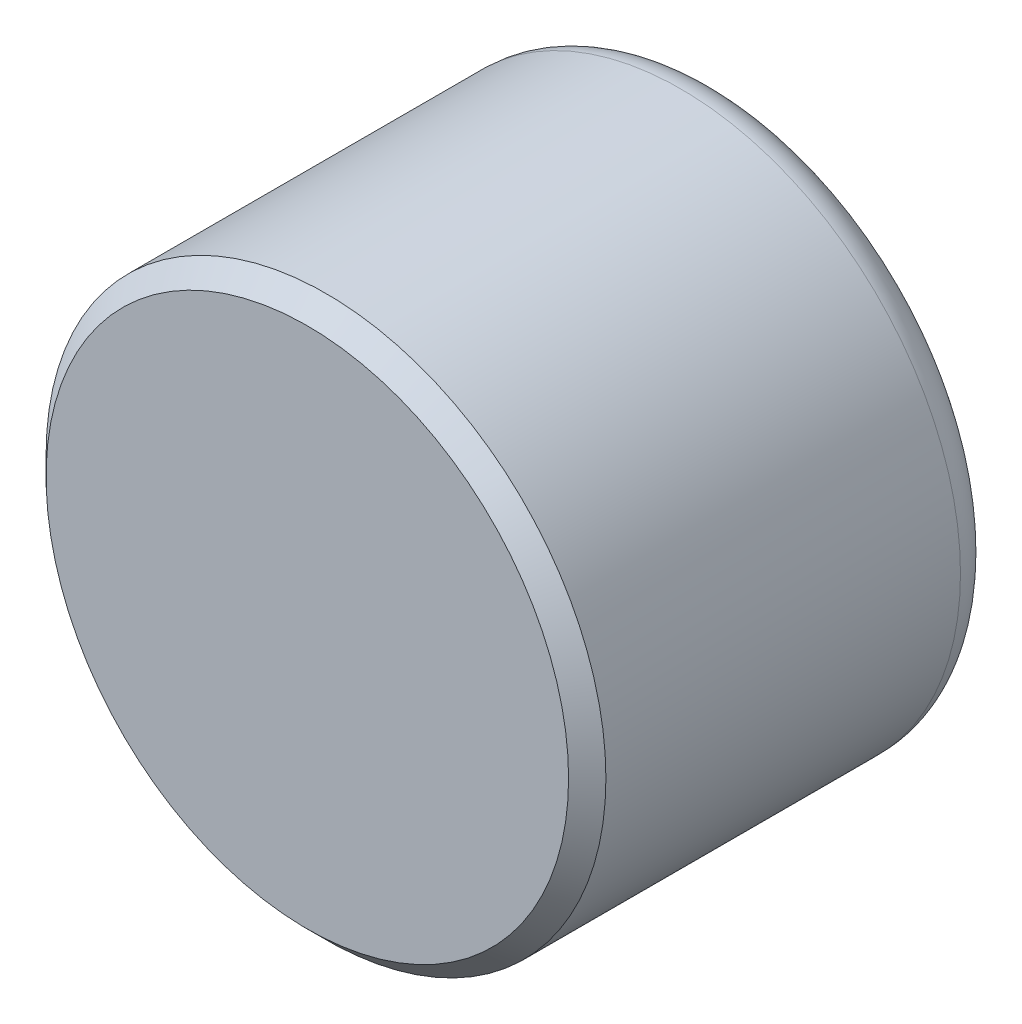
from build123d import *

# Parameters (mm, degrees)
ESQUISSE1_R             = 15
EXTRUSION1_DEPTH        = 22
ESQUISSE2_R             = 10
ENL_V_MAT_EXTRU_1_DEPTH = 15
CHANFREIN1_SIZE         = 1
CONG_2_R                = 2


with BuildPart() as part:
    # Esquisse1 → Extrusion1 (new body)
    with BuildSketch(Plane.XY):
        Circle(ESQUISSE1_R)
    extrude(amount=EXTRUSION1_DEPTH)

    # Esquisse2 → Enl_v. mat.-Extru.1 (cut)
    with BuildSketch(Plane(origin=(0, 0, 0), x_dir=(-1, 0, 0), z_dir=(0, 0, -1))):
        Circle(ESQUISSE2_R)
    extrude(amount=-ENL_V_MAT_EXTRU_1_DEPTH, mode=Mode.SUBTRACT)

    # Enl_v. mat.-Extru.2 cone 1 section (on through the dimple's axis) → Enl_v. mat.-Extru.2 (revolve, cut)
    with BuildSketch(Plane(origin=(0, 0, 15), x_dir=(0, 1, 0), z_dir=(1, 0, 0))):
        Polygon((0, 0), (3.5, 0), (0, 2.020725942), align=None)
    revolve(axis=Axis((0, 0, 15), (0, 0, 1)), mode=Mode.SUBTRACT)

    # Chanfrein1
    chanfrein1_edges = [part.edges().sort_by_distance(p)[0] for p in [
        (-15, 0, 22),
    ]]
    chamfer(chanfrein1_edges, length=CHANFREIN1_SIZE)

    # Cong_2
    cong_2_edges = [part.edges().sort_by_distance(p)[0] for p in [
        (-15, 0, 0),
        (10, 0, 0),
    ]]
    fillet(cong_2_edges, radius=CONG_2_R)


solid = part.part
